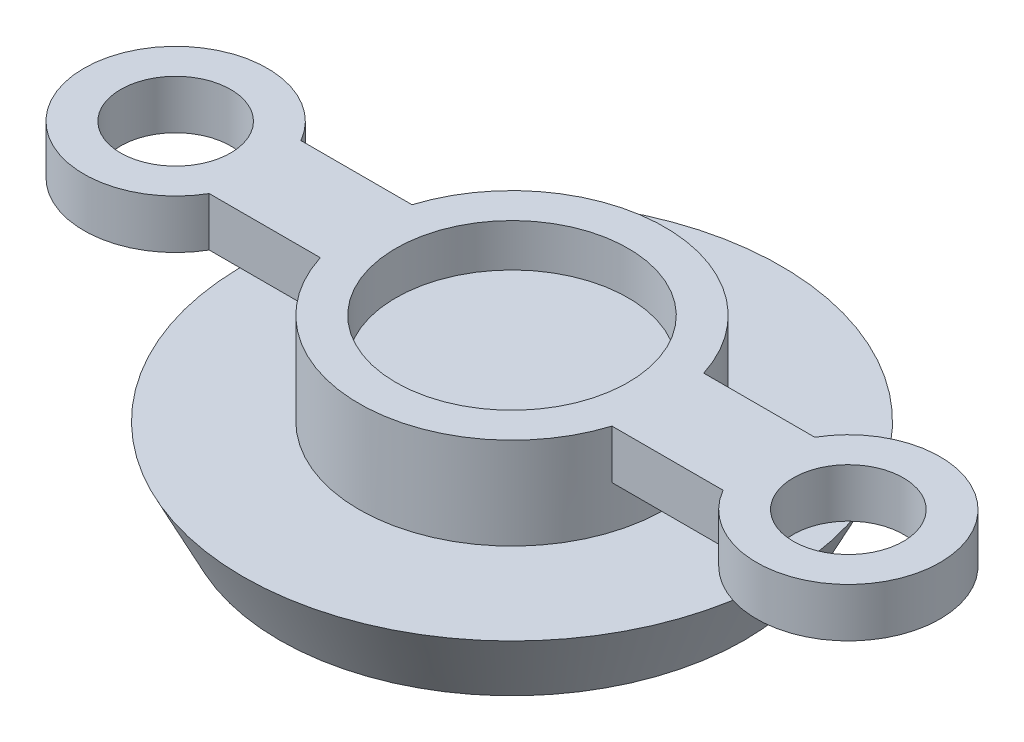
ISO-10303-21;
HEADER;
FILE_DESCRIPTION(('STEP AP214'),'2;1');
FILE_NAME('part.step','',(''),(''),'','','');
FILE_SCHEMA(('AUTOMOTIVE_DESIGN { 1 0 10303 214 1 1 1 1 }'));
ENDSEC;
DATA;
#1=APPLICATION_CONTEXT('core data for automotive mechanical design processes');
#2=APPLICATION_PROTOCOL_DEFINITION('international standard','automotive_design',2000,#1);
#3=PRODUCT_CONTEXT('',#1,'mechanical');
#4=PRODUCT('Part','Part','',(#3));
#5=PRODUCT_RELATED_PRODUCT_CATEGORY('part','',(#4));
#6=PRODUCT_DEFINITION_FORMATION('','',#4);
#7=PRODUCT_DEFINITION_CONTEXT('part definition',#1,'design');
#8=PRODUCT_DEFINITION('design','',#6,#7);
#9=PRODUCT_DEFINITION_SHAPE('','',#8);
#10=(LENGTH_UNIT() NAMED_UNIT(*) SI_UNIT(.MILLI.,.METRE.));
#11=(NAMED_UNIT(*) PLANE_ANGLE_UNIT() SI_UNIT($,.RADIAN.));
#12=(NAMED_UNIT(*) SI_UNIT($,.STERADIAN.) SOLID_ANGLE_UNIT());
#13=UNCERTAINTY_MEASURE_WITH_UNIT(LENGTH_MEASURE(1.E-05),#10,'distance_accuracy_value','');
#14=(GEOMETRIC_REPRESENTATION_CONTEXT(3) GLOBAL_UNCERTAINTY_ASSIGNED_CONTEXT((#13)) GLOBAL_UNIT_ASSIGNED_CONTEXT((#10,
#11,#12)) REPRESENTATION_CONTEXT('',''));
#15=CARTESIAN_POINT('',(0.,0.,0.));
#16=DIRECTION('',(0.,0.,1.));
#17=DIRECTION('',(1.,0.,0.));
#18=AXIS2_PLACEMENT_3D('',#15,#16,#17);
#19=CARTESIAN_POINT('',(0.,1.2,-5.75000000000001));
#20=DIRECTION('',(0.,-1.,0.));
#21=DIRECTION('',(0.,0.,-1.));
#22=AXIS2_PLACEMENT_3D('',#19,#20,#21);
#23=CYLINDRICAL_SURFACE('',#22,2.5);
#24=CARTESIAN_POINT('',(0.,-0.3,-5.75000000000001));
#25=DIRECTION('',(0.,1.,0.));
#26=DIRECTION('',(0.,0.,1.));
#27=AXIS2_PLACEMENT_3D('',#24,#25,#26);
#28=CIRCLE('',#27,2.5);
#29=CARTESIAN_POINT('',(0.,-0.3,-3.25));
#30=VERTEX_POINT('',#29);
#31=EDGE_CURVE('E187',#30,#30,#28,.T.);
#32=ORIENTED_EDGE('',*,*,#31,.T.);
#33=EDGE_LOOP('',(#32));
#34=FACE_BOUND('',#33,.T.);
#35=DIRECTION('',(0.,1.,0.));
#36=VECTOR('',#35,1.);
#37=CARTESIAN_POINT('',(2.38484800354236,0.4,-5.00000000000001));
#38=LINE('',#37,#36);
#39=CARTESIAN_POINT('',(2.38484800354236,0.4,-5.00000000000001));
#40=VERTEX_POINT('',#39);
#41=CARTESIAN_POINT('',(2.38484800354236,1.2,-5.00000000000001));
#42=VERTEX_POINT('',#41);
#43=EDGE_CURVE('E150',#40,#42,#38,.T.);
#44=ORIENTED_EDGE('',*,*,#43,.T.);
#45=CARTESIAN_POINT('',(0.,1.2,-5.75000000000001));
#46=DIRECTION('',(0.,1.,0.));
#47=DIRECTION('',(0.,0.,1.));
#48=AXIS2_PLACEMENT_3D('',#45,#46,#47);
#49=CIRCLE('',#48,2.5);
#50=CARTESIAN_POINT('',(-2.38484800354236,1.2,-5.00000000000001));
#51=VERTEX_POINT('',#50);
#52=EDGE_CURVE('E188',#51,#42,#49,.T.);
#53=ORIENTED_EDGE('',*,*,#52,.F.);
#54=DIRECTION('',(0.,1.,0.));
#55=VECTOR('',#54,1.);
#56=CARTESIAN_POINT('',(-2.38484800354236,0.4,-5.00000000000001));
#57=LINE('',#56,#55);
#58=CARTESIAN_POINT('',(-2.38484800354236,0.4,-5.00000000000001));
#59=VERTEX_POINT('',#58);
#60=EDGE_CURVE('E182',#59,#51,#57,.T.);
#61=ORIENTED_EDGE('',*,*,#60,.F.);
#62=CARTESIAN_POINT('',(0.,0.4,-5.75000000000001));
#63=DIRECTION('',(0.,1.,0.));
#64=DIRECTION('',(0.,0.,1.));
#65=AXIS2_PLACEMENT_3D('',#62,#63,#64);
#66=CIRCLE('',#65,2.5);
#67=CARTESIAN_POINT('',(-2.38484800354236,0.4,-6.50000000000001));
#68=VERTEX_POINT('',#67);
#69=EDGE_CURVE('E164',#68,#59,#66,.T.);
#70=ORIENTED_EDGE('',*,*,#69,.F.);
#71=DIRECTION('',(0.,1.,0.));
#72=VECTOR('',#71,1.);
#73=CARTESIAN_POINT('',(-2.38484800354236,0.4,-6.50000000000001));
#74=LINE('',#73,#72);
#75=CARTESIAN_POINT('',(-2.38484800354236,1.2,-6.50000000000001));
#76=VERTEX_POINT('',#75);
#77=EDGE_CURVE('E179',#68,#76,#74,.T.);
#78=ORIENTED_EDGE('',*,*,#77,.T.);
#79=CARTESIAN_POINT('',(2.38484800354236,1.2,-6.50000000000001));
#80=VERTEX_POINT('',#79);
#81=EDGE_CURVE('E191',#80,#76,#49,.T.);
#82=ORIENTED_EDGE('',*,*,#81,.F.);
#83=DIRECTION('',(0.,1.,0.));
#84=VECTOR('',#83,1.);
#85=CARTESIAN_POINT('',(2.38484800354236,0.4,-6.50000000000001));
#86=LINE('',#85,#84);
#87=CARTESIAN_POINT('',(2.38484800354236,0.4,-6.50000000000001));
#88=VERTEX_POINT('',#87);
#89=EDGE_CURVE('E120',#88,#80,#86,.T.);
#90=ORIENTED_EDGE('',*,*,#89,.F.);
#91=CARTESIAN_POINT('',(0.,0.4,-5.75000000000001));
#92=DIRECTION('',(0.,-1.,0.));
#93=DIRECTION('',(0.,0.,1.));
#94=AXIS2_PLACEMENT_3D('',#91,#92,#93);
#95=CIRCLE('',#94,2.5);
#96=EDGE_CURVE('E134',#88,#40,#95,.T.);
#97=ORIENTED_EDGE('',*,*,#96,.T.);
#98=EDGE_LOOP('',(#44,#53,#61,#70,#78,#82,#90,#97));
#99=FACE_BOUND('',#98,.T.);
#100=ADVANCED_FACE('F44',(#34,#99),#23,.T.);
#101=CARTESIAN_POINT('',(0.,-0.3,0.));
#102=DIRECTION('',(0.,1.,0.));
#103=DIRECTION('',(0.,0.,1.));
#104=AXIS2_PLACEMENT_3D('',#101,#102,#103);
#105=PLANE('',#104);
#106=CARTESIAN_POINT('',(0.,-0.3,-5.75000000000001));
#107=DIRECTION('',(0.,1.,0.));
#108=DIRECTION('',(0.,0.,1.));
#109=AXIS2_PLACEMENT_3D('',#106,#107,#108);
#110=CIRCLE('',#109,4.4);
#111=CARTESIAN_POINT('',(0.,-0.3,-1.35000000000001));
#112=VERTEX_POINT('',#111);
#113=EDGE_CURVE('E49',#112,#112,#110,.F.);
#114=ORIENTED_EDGE('',*,*,#113,.F.);
#115=EDGE_LOOP('',(#114));
#116=FACE_BOUND('',#115,.T.);
#117=ORIENTED_EDGE('',*,*,#31,.F.);
#118=EDGE_LOOP('',(#117));
#119=FACE_BOUND('',#118,.T.);
#120=ADVANCED_FACE('F212',(#116,#119),#105,.T.);
#121=CARTESIAN_POINT('',(0.,-1.5,-5.75000000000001));
#122=DIRECTION('',(0.,1.,0.));
#123=DIRECTION('',(0.,0.,1.));
#124=AXIS2_PLACEMENT_3D('',#121,#122,#123);
#125=CONICAL_SURFACE('',#124,3.8,0.463647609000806);
#126=CARTESIAN_POINT('',(0.,-1.5,-5.75000000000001));
#127=DIRECTION('',(0.,-1.,0.));
#128=DIRECTION('',(0.,0.,-1.));
#129=AXIS2_PLACEMENT_3D('',#126,#127,#128);
#130=CIRCLE('',#129,3.8);
#131=CARTESIAN_POINT('',(0.,-1.5,-9.55));
#132=VERTEX_POINT('',#131);
#133=EDGE_CURVE('E12',#132,#132,#130,.T.);
#134=ORIENTED_EDGE('',*,*,#133,.F.);
#135=EDGE_LOOP('',(#134));
#136=FACE_BOUND('',#135,.T.);
#137=ORIENTED_EDGE('',*,*,#113,.T.);
#138=EDGE_LOOP('',(#137));
#139=FACE_BOUND('',#138,.T.);
#140=ADVANCED_FACE('F203',(#136,#139),#125,.T.);
#141=CARTESIAN_POINT('',(0.,-1.5,-5.75000000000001));
#142=DIRECTION('',(0.,-1.,0.));
#143=DIRECTION('',(0.,0.,-1.));
#144=AXIS2_PLACEMENT_3D('',#141,#142,#143);
#145=PLANE('',#144);
#146=ORIENTED_EDGE('',*,*,#133,.T.);
#147=EDGE_LOOP('',(#146));
#148=FACE_BOUND('',#147,.T.);
#149=ADVANCED_FACE('F46',(#148),#145,.T.);
#150=CARTESIAN_POINT('',(0.,1.2,-5.75000000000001));
#151=DIRECTION('',(0.,1.,0.));
#152=DIRECTION('',(0.,0.,1.));
#153=AXIS2_PLACEMENT_3D('',#150,#151,#152);
#154=PLANE('',#153);
#155=ORIENTED_EDGE('',*,*,#52,.T.);
#156=DIRECTION('',(-1.,0.,0.));
#157=VECTOR('',#156,1.);
#158=CARTESIAN_POINT('',(0.,1.2,-5.00000000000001));
#159=LINE('',#158,#157);
#160=CARTESIAN_POINT('',(4.20096189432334,1.2,-5.00000000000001));
#161=VERTEX_POINT('',#160);
#162=EDGE_CURVE('E146',#161,#42,#159,.T.);
#163=ORIENTED_EDGE('',*,*,#162,.F.);
#164=CARTESIAN_POINT('',(5.5,1.2,-5.75000000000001));
#165=DIRECTION('',(0.,-1.,0.));
#166=DIRECTION('',(0.,0.,1.));
#167=AXIS2_PLACEMENT_3D('',#164,#165,#166);
#168=CIRCLE('',#167,1.5);
#169=CARTESIAN_POINT('',(4.20096189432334,1.2,-6.50000000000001));
#170=VERTEX_POINT('',#169);
#171=EDGE_CURVE('E143',#170,#161,#168,.T.);
#172=ORIENTED_EDGE('',*,*,#171,.F.);
#173=DIRECTION('',(-1.,0.,0.));
#174=VECTOR('',#173,1.);
#175=CARTESIAN_POINT('',(0.,1.2,-6.50000000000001));
#176=LINE('',#175,#174);
#177=EDGE_CURVE('E61',#170,#80,#176,.T.);
#178=ORIENTED_EDGE('',*,*,#177,.T.);
#179=ORIENTED_EDGE('',*,*,#81,.T.);
#180=DIRECTION('',(1.,0.,0.));
#181=VECTOR('',#180,1.);
#182=CARTESIAN_POINT('',(0.,1.2,-6.50000000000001));
#183=LINE('',#182,#181);
#184=CARTESIAN_POINT('',(-4.20096189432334,1.2,-6.50000000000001));
#185=VERTEX_POINT('',#184);
#186=EDGE_CURVE('E158',#185,#76,#183,.T.);
#187=ORIENTED_EDGE('',*,*,#186,.F.);
#188=CARTESIAN_POINT('',(-5.5,1.2,-5.75000000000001));
#189=DIRECTION('',(0.,1.,0.));
#190=DIRECTION('',(0.,0.,1.));
#191=AXIS2_PLACEMENT_3D('',#188,#189,#190);
#192=CIRCLE('',#191,1.5);
#193=CARTESIAN_POINT('',(-4.20096189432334,1.2,-5.00000000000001));
#194=VERTEX_POINT('',#193);
#195=EDGE_CURVE('E171',#185,#194,#192,.T.);
#196=ORIENTED_EDGE('',*,*,#195,.T.);
#197=DIRECTION('',(1.,0.,0.));
#198=VECTOR('',#197,1.);
#199=CARTESIAN_POINT('',(0.,1.2,-5.00000000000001));
#200=LINE('',#199,#198);
#201=EDGE_CURVE('E68',#194,#51,#200,.T.);
#202=ORIENTED_EDGE('',*,*,#201,.T.);
#203=EDGE_LOOP('',(#155,#163,#172,#178,#179,#187,#196,#202));
#204=FACE_BOUND('',#203,.T.);
#205=CARTESIAN_POINT('',(0.,1.2,-5.75000000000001));
#206=DIRECTION('',(0.,1.,0.));
#207=DIRECTION('',(0.,0.,1.));
#208=AXIS2_PLACEMENT_3D('',#205,#206,#207);
#209=CIRCLE('',#208,1.9);
#210=CARTESIAN_POINT('',(0.,1.2,-3.85));
#211=VERTEX_POINT('',#210);
#212=EDGE_CURVE('E178',#211,#211,#209,.T.);
#213=ORIENTED_EDGE('',*,*,#212,.F.);
#214=EDGE_LOOP('',(#213));
#215=FACE_BOUND('',#214,.T.);
#216=CARTESIAN_POINT('',(-5.5,1.2,-5.75000000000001));
#217=DIRECTION('',(0.,1.,0.));
#218=DIRECTION('',(0.,0.,1.));
#219=AXIS2_PLACEMENT_3D('',#216,#217,#218);
#220=CIRCLE('',#219,0.899999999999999);
#221=CARTESIAN_POINT('',(-5.5,1.2,-4.85));
#222=VERTEX_POINT('',#221);
#223=EDGE_CURVE('E149',#222,#222,#220,.T.);
#224=ORIENTED_EDGE('',*,*,#223,.F.);
#225=EDGE_LOOP('',(#224));
#226=FACE_BOUND('',#225,.T.);
#227=CARTESIAN_POINT('',(5.5,1.2,-5.75000000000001));
#228=DIRECTION('',(0.,-1.,0.));
#229=DIRECTION('',(0.,0.,1.));
#230=AXIS2_PLACEMENT_3D('',#227,#228,#229);
#231=CIRCLE('',#230,0.899999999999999);
#232=CARTESIAN_POINT('',(5.5,1.2,-4.85));
#233=VERTEX_POINT('',#232);
#234=EDGE_CURVE('E140',#233,#233,#231,.T.);
#235=ORIENTED_EDGE('',*,*,#234,.T.);
#236=EDGE_LOOP('',(#235));
#237=FACE_BOUND('',#236,.T.);
#238=ADVANCED_FACE('F225',(#204,#215,#226,#237),#154,.T.);
#239=CARTESIAN_POINT('',(0.,1.2,-5.75000000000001));
#240=DIRECTION('',(0.,-1.,0.));
#241=DIRECTION('',(0.,0.,-1.));
#242=AXIS2_PLACEMENT_3D('',#239,#240,#241);
#243=CYLINDRICAL_SURFACE('',#242,1.9);
#244=CARTESIAN_POINT('',(0.,0.5,-5.75000000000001));
#245=DIRECTION('',(0.,1.,0.));
#246=DIRECTION('',(0.,0.,1.));
#247=AXIS2_PLACEMENT_3D('',#244,#245,#246);
#248=CIRCLE('',#247,1.9);
#249=CARTESIAN_POINT('',(0.,0.5,-3.85));
#250=VERTEX_POINT('',#249);
#251=EDGE_CURVE('E190',#250,#250,#248,.F.);
#252=ORIENTED_EDGE('',*,*,#251,.T.);
#253=EDGE_LOOP('',(#252));
#254=FACE_BOUND('',#253,.T.);
#255=ORIENTED_EDGE('',*,*,#212,.T.);
#256=EDGE_LOOP('',(#255));
#257=FACE_BOUND('',#256,.T.);
#258=ADVANCED_FACE('F220',(#254,#257),#243,.F.);
#259=CARTESIAN_POINT('',(0.,0.5,-5.75000000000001));
#260=DIRECTION('',(0.,1.,0.));
#261=DIRECTION('',(0.,0.,1.));
#262=AXIS2_PLACEMENT_3D('',#259,#260,#261);
#263=PLANE('',#262);
#264=ORIENTED_EDGE('',*,*,#251,.F.);
#265=EDGE_LOOP('',(#264));
#266=FACE_BOUND('',#265,.T.);
#267=ADVANCED_FACE('F216',(#266),#263,.T.);
#268=CARTESIAN_POINT('',(-5.5,0.4,-5.75000000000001));
#269=DIRECTION('',(0.,1.,0.));
#270=DIRECTION('',(0.,0.,1.));
#271=AXIS2_PLACEMENT_3D('',#268,#269,#270);
#272=CYLINDRICAL_SURFACE('',#271,1.5);
#273=ORIENTED_EDGE('',*,*,#195,.F.);
#274=DIRECTION('',(0.,1.,0.));
#275=VECTOR('',#274,1.);
#276=CARTESIAN_POINT('',(-4.20096189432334,0.4,-6.50000000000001));
#277=LINE('',#276,#275);
#278=CARTESIAN_POINT('',(-4.20096189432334,0.4,-6.50000000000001));
#279=VERTEX_POINT('',#278);
#280=EDGE_CURVE('E176',#279,#185,#277,.T.);
#281=ORIENTED_EDGE('',*,*,#280,.F.);
#282=CARTESIAN_POINT('',(-5.5,0.4,-5.75000000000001));
#283=DIRECTION('',(0.,1.,0.));
#284=DIRECTION('',(0.,0.,1.));
#285=AXIS2_PLACEMENT_3D('',#282,#283,#284);
#286=CIRCLE('',#285,1.5);
#287=CARTESIAN_POINT('',(-4.20096189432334,0.4,-5.00000000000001));
#288=VERTEX_POINT('',#287);
#289=EDGE_CURVE('E157',#279,#288,#286,.T.);
#290=ORIENTED_EDGE('',*,*,#289,.T.);
#291=DIRECTION('',(0.,1.,0.));
#292=VECTOR('',#291,1.);
#293=CARTESIAN_POINT('',(-4.20096189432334,0.4,-5.00000000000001));
#294=LINE('',#293,#292);
#295=EDGE_CURVE('E168',#288,#194,#294,.T.);
#296=ORIENTED_EDGE('',*,*,#295,.T.);
#297=EDGE_LOOP('',(#273,#281,#290,#296));
#298=FACE_BOUND('',#297,.T.);
#299=ADVANCED_FACE('F219',(#298),#272,.T.);
#300=CARTESIAN_POINT('',(0.,0.4,-6.50000000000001));
#301=DIRECTION('',(0.,0.,1.));
#302=DIRECTION('',(1.,0.,0.));
#303=AXIS2_PLACEMENT_3D('',#300,#301,#302);
#304=PLANE('',#303);
#305=ORIENTED_EDGE('',*,*,#186,.T.);
#306=ORIENTED_EDGE('',*,*,#77,.F.);
#307=DIRECTION('',(1.,0.,0.));
#308=VECTOR('',#307,1.);
#309=CARTESIAN_POINT('',(0.,0.4,-6.50000000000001));
#310=LINE('',#309,#308);
#311=EDGE_CURVE('E166',#279,#68,#310,.T.);
#312=ORIENTED_EDGE('',*,*,#311,.F.);
#313=ORIENTED_EDGE('',*,*,#280,.T.);
#314=EDGE_LOOP('',(#305,#306,#312,#313));
#315=FACE_BOUND('',#314,.T.);
#316=ADVANCED_FACE('F235',(#315),#304,.F.);
#317=CARTESIAN_POINT('',(-5.5,0.4,-5.75000000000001));
#318=DIRECTION('',(0.,1.,0.));
#319=DIRECTION('',(0.,0.,1.));
#320=AXIS2_PLACEMENT_3D('',#317,#318,#319);
#321=CYLINDRICAL_SURFACE('',#320,0.899999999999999);
#322=CARTESIAN_POINT('',(-5.5,0.4,-5.75000000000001));
#323=DIRECTION('',(0.,1.,0.));
#324=DIRECTION('',(0.,0.,1.));
#325=AXIS2_PLACEMENT_3D('',#322,#323,#324);
#326=CIRCLE('',#325,0.899999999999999);
#327=CARTESIAN_POINT('',(-5.5,0.4,-4.85));
#328=VERTEX_POINT('',#327);
#329=EDGE_CURVE('E154',#328,#328,#326,.T.);
#330=ORIENTED_EDGE('',*,*,#329,.F.);
#331=EDGE_LOOP('',(#330));
#332=FACE_BOUND('',#331,.T.);
#333=ORIENTED_EDGE('',*,*,#223,.T.);
#334=EDGE_LOOP('',(#333));
#335=FACE_BOUND('',#334,.T.);
#336=ADVANCED_FACE('F231',(#332,#335),#321,.F.);
#337=CARTESIAN_POINT('',(0.,0.4,-5.00000000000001));
#338=DIRECTION('',(0.,0.,1.));
#339=DIRECTION('',(1.,0.,0.));
#340=AXIS2_PLACEMENT_3D('',#337,#338,#339);
#341=PLANE('',#340);
#342=ORIENTED_EDGE('',*,*,#201,.F.);
#343=ORIENTED_EDGE('',*,*,#295,.F.);
#344=DIRECTION('',(1.,0.,0.));
#345=VECTOR('',#344,1.);
#346=CARTESIAN_POINT('',(0.,0.4,-5.00000000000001));
#347=LINE('',#346,#345);
#348=EDGE_CURVE('E161',#288,#59,#347,.T.);
#349=ORIENTED_EDGE('',*,*,#348,.T.);
#350=ORIENTED_EDGE('',*,*,#60,.T.);
#351=EDGE_LOOP('',(#342,#343,#349,#350));
#352=FACE_BOUND('',#351,.T.);
#353=ADVANCED_FACE('F234',(#352),#341,.T.);
#354=CARTESIAN_POINT('',(0.,0.4,0.));
#355=DIRECTION('',(0.,1.,0.));
#356=DIRECTION('',(0.,0.,1.));
#357=AXIS2_PLACEMENT_3D('',#354,#355,#356);
#358=PLANE('',#357);
#359=ORIENTED_EDGE('',*,*,#329,.T.);
#360=EDGE_LOOP('',(#359));
#361=FACE_BOUND('',#360,.T.);
#362=ORIENTED_EDGE('',*,*,#289,.F.);
#363=ORIENTED_EDGE('',*,*,#311,.T.);
#364=ORIENTED_EDGE('',*,*,#69,.T.);
#365=ORIENTED_EDGE('',*,*,#348,.F.);
#366=EDGE_LOOP('',(#362,#363,#364,#365));
#367=FACE_BOUND('',#366,.T.);
#368=ADVANCED_FACE('F242',(#361,#367),#358,.F.);
#369=CARTESIAN_POINT('',(5.5,0.4,-5.75000000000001));
#370=DIRECTION('',(0.,1.,0.));
#371=DIRECTION('',(0.,0.,1.));
#372=AXIS2_PLACEMENT_3D('',#369,#370,#371);
#373=CYLINDRICAL_SURFACE('',#372,1.5);
#374=ORIENTED_EDGE('',*,*,#171,.T.);
#375=DIRECTION('',(0.,1.,0.));
#376=VECTOR('',#375,1.);
#377=CARTESIAN_POINT('',(4.20096189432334,0.4,-5.00000000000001));
#378=LINE('',#377,#376);
#379=CARTESIAN_POINT('',(4.20096189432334,0.4,-5.00000000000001));
#380=VERTEX_POINT('',#379);
#381=EDGE_CURVE('E128',#380,#161,#378,.T.);
#382=ORIENTED_EDGE('',*,*,#381,.F.);
#383=CARTESIAN_POINT('',(5.5,0.4,-5.75000000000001));
#384=DIRECTION('',(0.,-1.,0.));
#385=DIRECTION('',(0.,0.,1.));
#386=AXIS2_PLACEMENT_3D('',#383,#384,#385);
#387=CIRCLE('',#386,1.5);
#388=CARTESIAN_POINT('',(4.20096189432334,0.4,-6.50000000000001));
#389=VERTEX_POINT('',#388);
#390=EDGE_CURVE('E125',#389,#380,#387,.T.);
#391=ORIENTED_EDGE('',*,*,#390,.F.);
#392=DIRECTION('',(0.,1.,0.));
#393=VECTOR('',#392,1.);
#394=CARTESIAN_POINT('',(4.20096189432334,0.4,-6.50000000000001));
#395=LINE('',#394,#393);
#396=EDGE_CURVE('E112',#389,#170,#395,.T.);
#397=ORIENTED_EDGE('',*,*,#396,.T.);
#398=EDGE_LOOP('',(#374,#382,#391,#397));
#399=FACE_BOUND('',#398,.T.);
#400=ADVANCED_FACE('F126',(#399),#373,.T.);
#401=CARTESIAN_POINT('',(0.,0.4,-5.00000000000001));
#402=DIRECTION('',(0.,0.,-1.));
#403=DIRECTION('',(-1.,0.,0.));
#404=AXIS2_PLACEMENT_3D('',#401,#402,#403);
#405=PLANE('',#404);
#406=ORIENTED_EDGE('',*,*,#162,.T.);
#407=ORIENTED_EDGE('',*,*,#43,.F.);
#408=DIRECTION('',(-1.,0.,0.));
#409=VECTOR('',#408,1.);
#410=CARTESIAN_POINT('',(0.,0.4,-5.00000000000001));
#411=LINE('',#410,#409);
#412=EDGE_CURVE('E121',#380,#40,#411,.T.);
#413=ORIENTED_EDGE('',*,*,#412,.F.);
#414=ORIENTED_EDGE('',*,*,#381,.T.);
#415=EDGE_LOOP('',(#406,#407,#413,#414));
#416=FACE_BOUND('',#415,.T.);
#417=ADVANCED_FACE('F253',(#416),#405,.F.);
#418=CARTESIAN_POINT('',(5.5,0.4,-5.75000000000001));
#419=DIRECTION('',(0.,1.,0.));
#420=DIRECTION('',(0.,0.,1.));
#421=AXIS2_PLACEMENT_3D('',#418,#419,#420);
#422=CYLINDRICAL_SURFACE('',#421,0.899999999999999);
#423=CARTESIAN_POINT('',(5.5,0.4,-5.75000000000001));
#424=DIRECTION('',(0.,-1.,0.));
#425=DIRECTION('',(0.,0.,1.));
#426=AXIS2_PLACEMENT_3D('',#423,#424,#425);
#427=CIRCLE('',#426,0.899999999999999);
#428=CARTESIAN_POINT('',(5.5,0.4,-4.85));
#429=VERTEX_POINT('',#428);
#430=EDGE_CURVE('E130',#429,#429,#427,.T.);
#431=ORIENTED_EDGE('',*,*,#430,.T.);
#432=EDGE_LOOP('',(#431));
#433=FACE_BOUND('',#432,.T.);
#434=ORIENTED_EDGE('',*,*,#234,.F.);
#435=EDGE_LOOP('',(#434));
#436=FACE_BOUND('',#435,.T.);
#437=ADVANCED_FACE('F250',(#433,#436),#422,.F.);
#438=CARTESIAN_POINT('',(0.,0.4,-6.50000000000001));
#439=DIRECTION('',(0.,0.,-1.));
#440=DIRECTION('',(-1.,0.,0.));
#441=AXIS2_PLACEMENT_3D('',#438,#439,#440);
#442=PLANE('',#441);
#443=ORIENTED_EDGE('',*,*,#177,.F.);
#444=ORIENTED_EDGE('',*,*,#396,.F.);
#445=DIRECTION('',(-1.,0.,0.));
#446=VECTOR('',#445,1.);
#447=CARTESIAN_POINT('',(0.,0.4,-6.50000000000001));
#448=LINE('',#447,#446);
#449=EDGE_CURVE('E116',#389,#88,#448,.T.);
#450=ORIENTED_EDGE('',*,*,#449,.T.);
#451=ORIENTED_EDGE('',*,*,#89,.T.);
#452=EDGE_LOOP('',(#443,#444,#450,#451));
#453=FACE_BOUND('',#452,.T.);
#454=ADVANCED_FACE('F114',(#453),#442,.T.);
#455=CARTESIAN_POINT('',(0.,0.4,0.));
#456=DIRECTION('',(0.,1.,0.));
#457=DIRECTION('',(0.,0.,1.));
#458=AXIS2_PLACEMENT_3D('',#455,#456,#457);
#459=PLANE('',#458);
#460=ORIENTED_EDGE('',*,*,#430,.F.);
#461=EDGE_LOOP('',(#460));
#462=FACE_BOUND('',#461,.T.);
#463=ORIENTED_EDGE('',*,*,#390,.T.);
#464=ORIENTED_EDGE('',*,*,#412,.T.);
#465=ORIENTED_EDGE('',*,*,#96,.F.);
#466=ORIENTED_EDGE('',*,*,#449,.F.);
#467=EDGE_LOOP('',(#463,#464,#465,#466));
#468=FACE_BOUND('',#467,.T.);
#469=ADVANCED_FACE('F132',(#462,#468),#459,.F.);
#470=CLOSED_SHELL('',(#100,#120,#140,#149,#238,#258,#267,#299,#316,#336,#353,#368,#400,#417,
#437,#454,#469));
#471=MANIFOLD_SOLID_BREP('B2',#470);
#472=ADVANCED_BREP_SHAPE_REPRESENTATION('',(#18,#471),#14);
#473=SHAPE_DEFINITION_REPRESENTATION(#9,#472);
ENDSEC;
END-ISO-10303-21;
